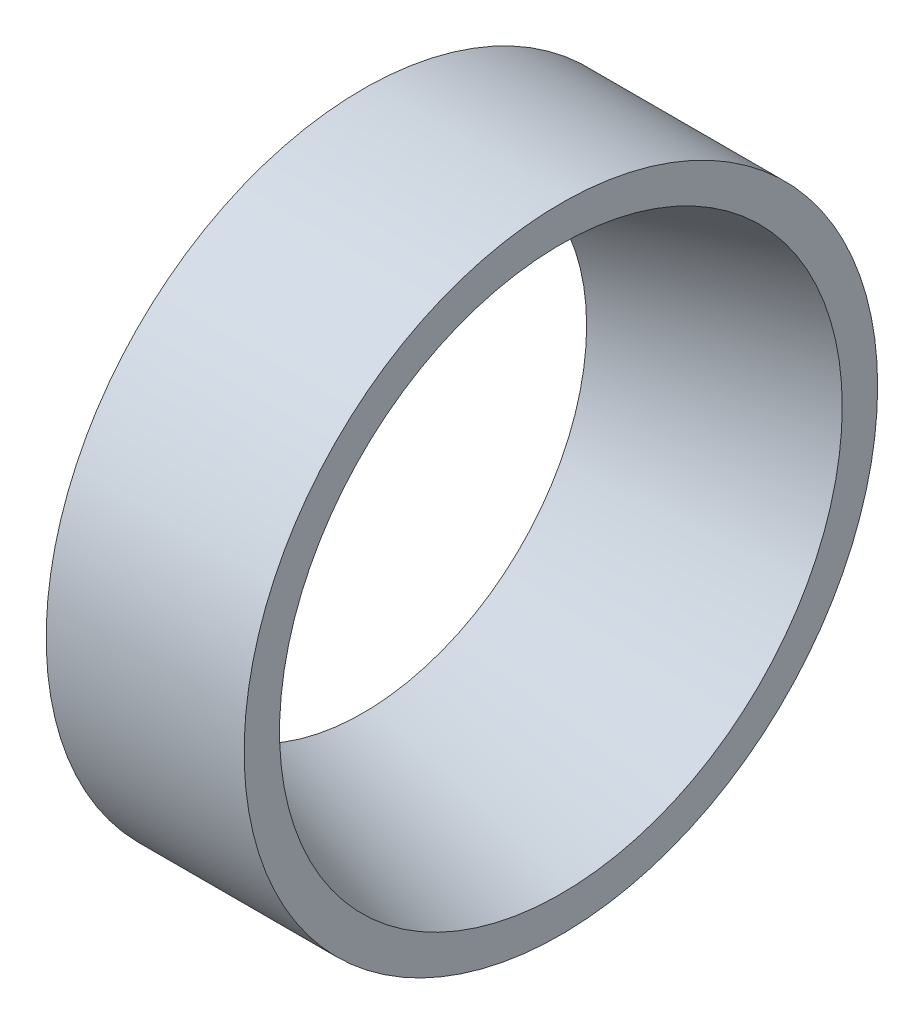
from build123d import *


with BuildPart() as part:
    # Esquisse1 → Base-R_volution (revolve)
    with BuildSketch(Plane.XY, mode=Mode.PRIVATE) as base_r_volution_sk:
        Polygon((0, 14.212), (0, 16), (-10, 16), (-10, 11.3), align=None)
    revolve(base_r_volution_sk.sketch.rotate(Axis((40, 0, 0), (-1, 0, 0)), 90), axis=Axis((40, 0, 0), (-1, 0, 0)))


solid = part.part
